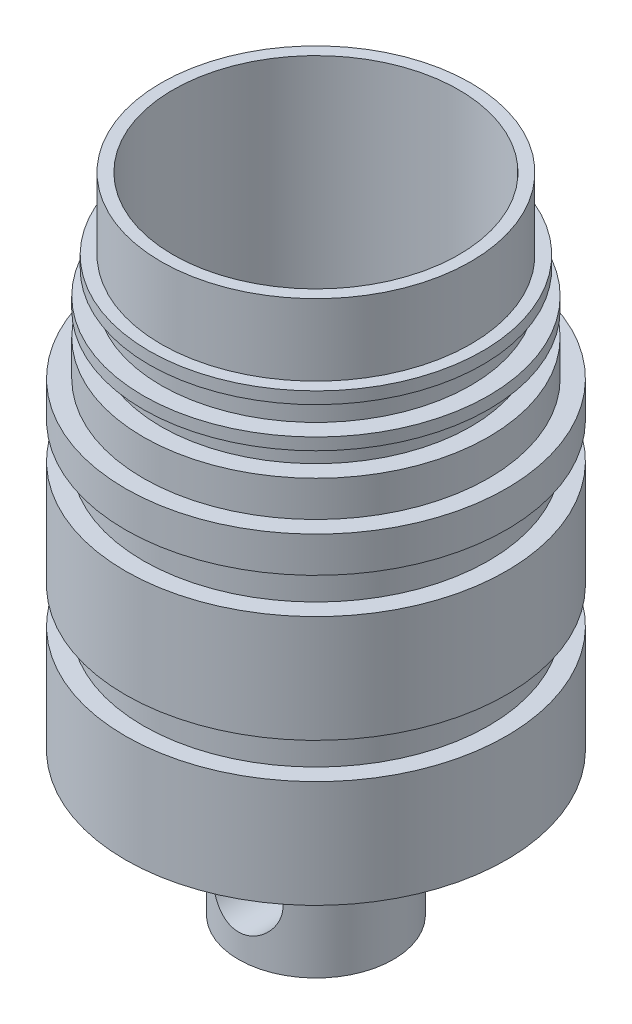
ISO-10303-21;
HEADER;
FILE_DESCRIPTION(('STEP AP214'),'2;1');
FILE_NAME('part.step','',(''),(''),'','','');
FILE_SCHEMA(('AUTOMOTIVE_DESIGN { 1 0 10303 214 1 1 1 1 }'));
ENDSEC;
DATA;
#1=APPLICATION_CONTEXT('core data for automotive mechanical design processes');
#2=APPLICATION_PROTOCOL_DEFINITION('international standard','automotive_design',2000,#1);
#3=PRODUCT_CONTEXT('',#1,'mechanical');
#4=PRODUCT('Part','Part','',(#3));
#5=PRODUCT_RELATED_PRODUCT_CATEGORY('part','',(#4));
#6=PRODUCT_DEFINITION_FORMATION('','',#4);
#7=PRODUCT_DEFINITION_CONTEXT('part definition',#1,'design');
#8=PRODUCT_DEFINITION('design','',#6,#7);
#9=PRODUCT_DEFINITION_SHAPE('','',#8);
#10=(LENGTH_UNIT() NAMED_UNIT(*) SI_UNIT(.MILLI.,.METRE.));
#11=(NAMED_UNIT(*) PLANE_ANGLE_UNIT() SI_UNIT($,.RADIAN.));
#12=(NAMED_UNIT(*) SI_UNIT($,.STERADIAN.) SOLID_ANGLE_UNIT());
#13=UNCERTAINTY_MEASURE_WITH_UNIT(LENGTH_MEASURE(1.E-05),#10,'distance_accuracy_value','');
#14=(GEOMETRIC_REPRESENTATION_CONTEXT(3) GLOBAL_UNCERTAINTY_ASSIGNED_CONTEXT((#13)) GLOBAL_UNIT_ASSIGNED_CONTEXT((#10,
#11,#12)) REPRESENTATION_CONTEXT('',''));
#15=CARTESIAN_POINT('',(0.,0.,0.));
#16=DIRECTION('',(0.,0.,1.));
#17=DIRECTION('',(1.,0.,0.));
#18=AXIS2_PLACEMENT_3D('',#15,#16,#17);
#19=CARTESIAN_POINT('',(0.,20.5,-6.5));
#20=DIRECTION('',(0.,-1.,0.));
#21=DIRECTION('',(0.,0.,-1.));
#22=AXIS2_PLACEMENT_3D('',#19,#20,#21);
#23=PLANE('',#22);
#24=CARTESIAN_POINT('',(0.,20.5,0.));
#25=DIRECTION('',(0.,1.,0.));
#26=DIRECTION('',(0.,0.,1.));
#27=AXIS2_PLACEMENT_3D('',#24,#25,#26);
#28=CIRCLE('',#27,6.);
#29=CARTESIAN_POINT('',(0.,20.5,6.));
#30=VERTEX_POINT('',#29);
#31=EDGE_CURVE('E59',#30,#30,#28,.T.);
#32=ORIENTED_EDGE('',*,*,#31,.F.);
#33=EDGE_LOOP('',(#32));
#34=FACE_BOUND('',#33,.T.);
#35=CARTESIAN_POINT('',(0.,20.5,0.));
#36=DIRECTION('',(0.,1.,0.));
#37=DIRECTION('',(0.,0.,1.));
#38=AXIS2_PLACEMENT_3D('',#35,#36,#37);
#39=CIRCLE('',#38,6.5);
#40=CARTESIAN_POINT('',(0.,20.5,6.5));
#41=VERTEX_POINT('',#40);
#42=EDGE_CURVE('E11',#41,#41,#39,.T.);
#43=ORIENTED_EDGE('',*,*,#42,.T.);
#44=EDGE_LOOP('',(#43));
#45=FACE_BOUND('',#44,.T.);
#46=ADVANCED_FACE('F33',(#34,#45),#23,.F.);
#47=CARTESIAN_POINT('',(0.,26.4066222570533,0.));
#48=DIRECTION('',(0.,1.,0.));
#49=DIRECTION('',(0.,0.,1.));
#50=AXIS2_PLACEMENT_3D('',#47,#48,#49);
#51=CYLINDRICAL_SURFACE('',#50,6.5);
#52=ORIENTED_EDGE('',*,*,#42,.F.);
#53=EDGE_LOOP('',(#52));
#54=FACE_BOUND('',#53,.T.);
#55=CARTESIAN_POINT('',(0.,17.5,0.));
#56=DIRECTION('',(0.,1.,0.));
#57=DIRECTION('',(0.,0.,1.));
#58=AXIS2_PLACEMENT_3D('',#55,#56,#57);
#59=CIRCLE('',#58,6.5);
#60=CARTESIAN_POINT('',(0.,17.5,6.5));
#61=VERTEX_POINT('',#60);
#62=EDGE_CURVE('E44',#61,#61,#59,.T.);
#63=ORIENTED_EDGE('',*,*,#62,.T.);
#64=EDGE_LOOP('',(#63));
#65=FACE_BOUND('',#64,.T.);
#66=ADVANCED_FACE('F154',(#54,#65),#51,.T.);
#67=CARTESIAN_POINT('',(0.,17.5,-7.));
#68=DIRECTION('',(0.,-1.,0.));
#69=DIRECTION('',(0.,0.,-1.));
#70=AXIS2_PLACEMENT_3D('',#67,#68,#69);
#71=PLANE('',#70);
#72=ORIENTED_EDGE('',*,*,#62,.F.);
#73=EDGE_LOOP('',(#72));
#74=FACE_BOUND('',#73,.T.);
#75=CARTESIAN_POINT('',(0.,17.5,0.));
#76=DIRECTION('',(0.,1.,0.));
#77=DIRECTION('',(0.,0.,1.));
#78=AXIS2_PLACEMENT_3D('',#75,#76,#77);
#79=CIRCLE('',#78,7.);
#80=CARTESIAN_POINT('',(0.,17.5,7.));
#81=VERTEX_POINT('',#80);
#82=EDGE_CURVE('E126',#81,#81,#79,.T.);
#83=ORIENTED_EDGE('',*,*,#82,.T.);
#84=EDGE_LOOP('',(#83));
#85=FACE_BOUND('',#84,.T.);
#86=ADVANCED_FACE('F159',(#74,#85),#71,.F.);
#87=CARTESIAN_POINT('',(0.,26.4066222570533,0.));
#88=DIRECTION('',(0.,1.,0.));
#89=DIRECTION('',(0.,0.,1.));
#90=AXIS2_PLACEMENT_3D('',#87,#88,#89);
#91=CYLINDRICAL_SURFACE('',#90,7.);
#92=ORIENTED_EDGE('',*,*,#82,.F.);
#93=EDGE_LOOP('',(#92));
#94=FACE_BOUND('',#93,.T.);
#95=CARTESIAN_POINT('',(0.,17.,0.));
#96=DIRECTION('',(0.,1.,0.));
#97=DIRECTION('',(0.,0.,1.));
#98=AXIS2_PLACEMENT_3D('',#95,#96,#97);
#99=CIRCLE('',#98,7.);
#100=CARTESIAN_POINT('',(0.,17.,7.));
#101=VERTEX_POINT('',#100);
#102=EDGE_CURVE('E123',#101,#101,#99,.T.);
#103=ORIENTED_EDGE('',*,*,#102,.T.);
#104=EDGE_LOOP('',(#103));
#105=FACE_BOUND('',#104,.T.);
#106=ADVANCED_FACE('F169',(#94,#105),#91,.T.);
#107=CARTESIAN_POINT('',(0.,17.,-6.5));
#108=DIRECTION('',(0.,1.,0.));
#109=DIRECTION('',(0.,0.,1.));
#110=AXIS2_PLACEMENT_3D('',#107,#108,#109);
#111=PLANE('',#110);
#112=ORIENTED_EDGE('',*,*,#102,.F.);
#113=EDGE_LOOP('',(#112));
#114=FACE_BOUND('',#113,.T.);
#115=CARTESIAN_POINT('',(0.,17.,0.));
#116=DIRECTION('',(0.,1.,0.));
#117=DIRECTION('',(0.,0.,1.));
#118=AXIS2_PLACEMENT_3D('',#115,#116,#117);
#119=CIRCLE('',#118,6.5);
#120=CARTESIAN_POINT('',(0.,17.,6.5));
#121=VERTEX_POINT('',#120);
#122=EDGE_CURVE('E120',#121,#121,#119,.T.);
#123=ORIENTED_EDGE('',*,*,#122,.T.);
#124=EDGE_LOOP('',(#123));
#125=FACE_BOUND('',#124,.T.);
#126=ADVANCED_FACE('F175',(#114,#125),#111,.F.);
#127=CARTESIAN_POINT('',(0.,26.4066222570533,0.));
#128=DIRECTION('',(0.,1.,0.));
#129=DIRECTION('',(0.,0.,1.));
#130=AXIS2_PLACEMENT_3D('',#127,#128,#129);
#131=CYLINDRICAL_SURFACE('',#130,6.5);
#132=ORIENTED_EDGE('',*,*,#122,.F.);
#133=EDGE_LOOP('',(#132));
#134=FACE_BOUND('',#133,.T.);
#135=CARTESIAN_POINT('',(0.,16.,0.));
#136=DIRECTION('',(0.,1.,0.));
#137=DIRECTION('',(0.,0.,1.));
#138=AXIS2_PLACEMENT_3D('',#135,#136,#137);
#139=CIRCLE('',#138,6.5);
#140=CARTESIAN_POINT('',(0.,16.,6.5));
#141=VERTEX_POINT('',#140);
#142=EDGE_CURVE('E117',#141,#141,#139,.T.);
#143=ORIENTED_EDGE('',*,*,#142,.T.);
#144=EDGE_LOOP('',(#143));
#145=FACE_BOUND('',#144,.T.);
#146=ADVANCED_FACE('F181',(#134,#145),#131,.T.);
#147=CARTESIAN_POINT('',(0.,16.,-7.25));
#148=DIRECTION('',(0.,-1.,0.));
#149=DIRECTION('',(0.,0.,-1.));
#150=AXIS2_PLACEMENT_3D('',#147,#148,#149);
#151=PLANE('',#150);
#152=ORIENTED_EDGE('',*,*,#142,.F.);
#153=EDGE_LOOP('',(#152));
#154=FACE_BOUND('',#153,.T.);
#155=CARTESIAN_POINT('',(0.,16.,0.));
#156=DIRECTION('',(0.,1.,0.));
#157=DIRECTION('',(0.,0.,1.));
#158=AXIS2_PLACEMENT_3D('',#155,#156,#157);
#159=CIRCLE('',#158,7.25);
#160=CARTESIAN_POINT('',(0.,16.,7.25));
#161=VERTEX_POINT('',#160);
#162=EDGE_CURVE('E114',#161,#161,#159,.T.);
#163=ORIENTED_EDGE('',*,*,#162,.T.);
#164=EDGE_LOOP('',(#163));
#165=FACE_BOUND('',#164,.T.);
#166=ADVANCED_FACE('F187',(#154,#165),#151,.F.);
#167=CARTESIAN_POINT('',(0.,26.4066222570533,0.));
#168=DIRECTION('',(0.,1.,0.));
#169=DIRECTION('',(0.,0.,1.));
#170=AXIS2_PLACEMENT_3D('',#167,#168,#169);
#171=CYLINDRICAL_SURFACE('',#170,7.25);
#172=ORIENTED_EDGE('',*,*,#162,.F.);
#173=EDGE_LOOP('',(#172));
#174=FACE_BOUND('',#173,.T.);
#175=CARTESIAN_POINT('',(0.,15.5,0.));
#176=DIRECTION('',(0.,1.,0.));
#177=DIRECTION('',(0.,0.,1.));
#178=AXIS2_PLACEMENT_3D('',#175,#176,#177);
#179=CIRCLE('',#178,7.25);
#180=CARTESIAN_POINT('',(0.,15.5,7.25));
#181=VERTEX_POINT('',#180);
#182=EDGE_CURVE('E111',#181,#181,#179,.T.);
#183=ORIENTED_EDGE('',*,*,#182,.T.);
#184=EDGE_LOOP('',(#183));
#185=FACE_BOUND('',#184,.T.);
#186=ADVANCED_FACE('F193',(#174,#185),#171,.T.);
#187=CARTESIAN_POINT('',(0.,15.5,-6.5));
#188=DIRECTION('',(0.,1.,0.));
#189=DIRECTION('',(0.,0.,1.));
#190=AXIS2_PLACEMENT_3D('',#187,#188,#189);
#191=PLANE('',#190);
#192=ORIENTED_EDGE('',*,*,#182,.F.);
#193=EDGE_LOOP('',(#192));
#194=FACE_BOUND('',#193,.T.);
#195=CARTESIAN_POINT('',(0.,15.5,0.));
#196=DIRECTION('',(0.,1.,0.));
#197=DIRECTION('',(0.,0.,1.));
#198=AXIS2_PLACEMENT_3D('',#195,#196,#197);
#199=CIRCLE('',#198,6.5);
#200=CARTESIAN_POINT('',(0.,15.5,6.5));
#201=VERTEX_POINT('',#200);
#202=EDGE_CURVE('E108',#201,#201,#199,.T.);
#203=ORIENTED_EDGE('',*,*,#202,.T.);
#204=EDGE_LOOP('',(#203));
#205=FACE_BOUND('',#204,.T.);
#206=ADVANCED_FACE('F199',(#194,#205),#191,.F.);
#207=CARTESIAN_POINT('',(0.,26.4066222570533,0.));
#208=DIRECTION('',(0.,1.,0.));
#209=DIRECTION('',(0.,0.,1.));
#210=AXIS2_PLACEMENT_3D('',#207,#208,#209);
#211=CYLINDRICAL_SURFACE('',#210,6.5);
#212=ORIENTED_EDGE('',*,*,#202,.F.);
#213=EDGE_LOOP('',(#212));
#214=FACE_BOUND('',#213,.T.);
#215=CARTESIAN_POINT('',(0.,14.5,0.));
#216=DIRECTION('',(0.,1.,0.));
#217=DIRECTION('',(0.,0.,1.));
#218=AXIS2_PLACEMENT_3D('',#215,#216,#217);
#219=CIRCLE('',#218,6.5);
#220=CARTESIAN_POINT('',(0.,14.5,6.5));
#221=VERTEX_POINT('',#220);
#222=EDGE_CURVE('E105',#221,#221,#219,.T.);
#223=ORIENTED_EDGE('',*,*,#222,.T.);
#224=EDGE_LOOP('',(#223));
#225=FACE_BOUND('',#224,.T.);
#226=ADVANCED_FACE('F205',(#214,#225),#211,.T.);
#227=CARTESIAN_POINT('',(0.,14.5,-7.25));
#228=DIRECTION('',(0.,-1.,0.));
#229=DIRECTION('',(0.,0.,-1.));
#230=AXIS2_PLACEMENT_3D('',#227,#228,#229);
#231=PLANE('',#230);
#232=ORIENTED_EDGE('',*,*,#222,.F.);
#233=EDGE_LOOP('',(#232));
#234=FACE_BOUND('',#233,.T.);
#235=CARTESIAN_POINT('',(0.,14.5,0.));
#236=DIRECTION('',(0.,1.,0.));
#237=DIRECTION('',(0.,0.,1.));
#238=AXIS2_PLACEMENT_3D('',#235,#236,#237);
#239=CIRCLE('',#238,7.25);
#240=CARTESIAN_POINT('',(0.,14.5,7.25));
#241=VERTEX_POINT('',#240);
#242=EDGE_CURVE('E102',#241,#241,#239,.T.);
#243=ORIENTED_EDGE('',*,*,#242,.T.);
#244=EDGE_LOOP('',(#243));
#245=FACE_BOUND('',#244,.T.);
#246=ADVANCED_FACE('F211',(#234,#245),#231,.F.);
#247=CARTESIAN_POINT('',(0.,26.4066222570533,0.));
#248=DIRECTION('',(0.,1.,0.));
#249=DIRECTION('',(0.,0.,1.));
#250=AXIS2_PLACEMENT_3D('',#247,#248,#249);
#251=CYLINDRICAL_SURFACE('',#250,7.25);
#252=ORIENTED_EDGE('',*,*,#242,.F.);
#253=EDGE_LOOP('',(#252));
#254=FACE_BOUND('',#253,.T.);
#255=CARTESIAN_POINT('',(0.,13.,0.));
#256=DIRECTION('',(0.,1.,0.));
#257=DIRECTION('',(0.,0.,1.));
#258=AXIS2_PLACEMENT_3D('',#255,#256,#257);
#259=CIRCLE('',#258,7.25);
#260=CARTESIAN_POINT('',(0.,13.,7.25));
#261=VERTEX_POINT('',#260);
#262=EDGE_CURVE('E99',#261,#261,#259,.T.);
#263=ORIENTED_EDGE('',*,*,#262,.T.);
#264=EDGE_LOOP('',(#263));
#265=FACE_BOUND('',#264,.T.);
#266=ADVANCED_FACE('F217',(#254,#265),#251,.T.);
#267=CARTESIAN_POINT('',(0.,13.,-8.));
#268=DIRECTION('',(0.,-1.,0.));
#269=DIRECTION('',(0.,0.,-1.));
#270=AXIS2_PLACEMENT_3D('',#267,#268,#269);
#271=PLANE('',#270);
#272=ORIENTED_EDGE('',*,*,#262,.F.);
#273=EDGE_LOOP('',(#272));
#274=FACE_BOUND('',#273,.T.);
#275=CARTESIAN_POINT('',(0.,13.,0.));
#276=DIRECTION('',(0.,1.,0.));
#277=DIRECTION('',(0.,0.,1.));
#278=AXIS2_PLACEMENT_3D('',#275,#276,#277);
#279=CIRCLE('',#278,8.);
#280=CARTESIAN_POINT('',(0.,13.,8.));
#281=VERTEX_POINT('',#280);
#282=EDGE_CURVE('E96',#281,#281,#279,.T.);
#283=ORIENTED_EDGE('',*,*,#282,.T.);
#284=EDGE_LOOP('',(#283));
#285=FACE_BOUND('',#284,.T.);
#286=ADVANCED_FACE('F223',(#274,#285),#271,.F.);
#287=CARTESIAN_POINT('',(0.,26.4066222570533,0.));
#288=DIRECTION('',(0.,1.,0.));
#289=DIRECTION('',(0.,0.,1.));
#290=AXIS2_PLACEMENT_3D('',#287,#288,#289);
#291=CYLINDRICAL_SURFACE('',#290,8.);
#292=ORIENTED_EDGE('',*,*,#282,.F.);
#293=EDGE_LOOP('',(#292));
#294=FACE_BOUND('',#293,.T.);
#295=CARTESIAN_POINT('',(0.,11.5,0.));
#296=DIRECTION('',(0.,1.,0.));
#297=DIRECTION('',(0.,0.,1.));
#298=AXIS2_PLACEMENT_3D('',#295,#296,#297);
#299=CIRCLE('',#298,8.);
#300=CARTESIAN_POINT('',(0.,11.5,8.));
#301=VERTEX_POINT('',#300);
#302=EDGE_CURVE('E93',#301,#301,#299,.T.);
#303=ORIENTED_EDGE('',*,*,#302,.T.);
#304=EDGE_LOOP('',(#303));
#305=FACE_BOUND('',#304,.T.);
#306=ADVANCED_FACE('F229',(#294,#305),#291,.T.);
#307=CARTESIAN_POINT('',(0.,11.5,-7.25));
#308=DIRECTION('',(0.,1.,0.));
#309=DIRECTION('',(0.,0.,1.));
#310=AXIS2_PLACEMENT_3D('',#307,#308,#309);
#311=PLANE('',#310);
#312=ORIENTED_EDGE('',*,*,#302,.F.);
#313=EDGE_LOOP('',(#312));
#314=FACE_BOUND('',#313,.T.);
#315=CARTESIAN_POINT('',(0.,11.5,0.));
#316=DIRECTION('',(0.,1.,0.));
#317=DIRECTION('',(0.,0.,1.));
#318=AXIS2_PLACEMENT_3D('',#315,#316,#317);
#319=CIRCLE('',#318,7.25);
#320=CARTESIAN_POINT('',(0.,11.5,7.25));
#321=VERTEX_POINT('',#320);
#322=EDGE_CURVE('E90',#321,#321,#319,.T.);
#323=ORIENTED_EDGE('',*,*,#322,.T.);
#324=EDGE_LOOP('',(#323));
#325=FACE_BOUND('',#324,.T.);
#326=ADVANCED_FACE('F235',(#314,#325),#311,.F.);
#327=CARTESIAN_POINT('',(0.,26.4066222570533,0.));
#328=DIRECTION('',(0.,1.,0.));
#329=DIRECTION('',(0.,0.,1.));
#330=AXIS2_PLACEMENT_3D('',#327,#328,#329);
#331=CYLINDRICAL_SURFACE('',#330,7.25);
#332=ORIENTED_EDGE('',*,*,#322,.F.);
#333=EDGE_LOOP('',(#332));
#334=FACE_BOUND('',#333,.T.);
#335=CARTESIAN_POINT('',(0.,10.,0.));
#336=DIRECTION('',(0.,1.,0.));
#337=DIRECTION('',(0.,0.,1.));
#338=AXIS2_PLACEMENT_3D('',#335,#336,#337);
#339=CIRCLE('',#338,7.25);
#340=CARTESIAN_POINT('',(0.,10.,7.25));
#341=VERTEX_POINT('',#340);
#342=EDGE_CURVE('E87',#341,#341,#339,.T.);
#343=ORIENTED_EDGE('',*,*,#342,.T.);
#344=EDGE_LOOP('',(#343));
#345=FACE_BOUND('',#344,.T.);
#346=ADVANCED_FACE('F241',(#334,#345),#331,.T.);
#347=CARTESIAN_POINT('',(0.,10.,-8.));
#348=DIRECTION('',(0.,-1.,0.));
#349=DIRECTION('',(0.,0.,-1.));
#350=AXIS2_PLACEMENT_3D('',#347,#348,#349);
#351=PLANE('',#350);
#352=ORIENTED_EDGE('',*,*,#342,.F.);
#353=EDGE_LOOP('',(#352));
#354=FACE_BOUND('',#353,.T.);
#355=CARTESIAN_POINT('',(0.,10.,0.));
#356=DIRECTION('',(0.,1.,0.));
#357=DIRECTION('',(0.,0.,1.));
#358=AXIS2_PLACEMENT_3D('',#355,#356,#357);
#359=CIRCLE('',#358,8.);
#360=CARTESIAN_POINT('',(0.,10.,8.));
#361=VERTEX_POINT('',#360);
#362=EDGE_CURVE('E84',#361,#361,#359,.T.);
#363=ORIENTED_EDGE('',*,*,#362,.T.);
#364=EDGE_LOOP('',(#363));
#365=FACE_BOUND('',#364,.T.);
#366=ADVANCED_FACE('F247',(#354,#365),#351,.F.);
#367=CARTESIAN_POINT('',(0.,26.4066222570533,0.));
#368=DIRECTION('',(0.,1.,0.));
#369=DIRECTION('',(0.,0.,1.));
#370=AXIS2_PLACEMENT_3D('',#367,#368,#369);
#371=CYLINDRICAL_SURFACE('',#370,8.);
#372=ORIENTED_EDGE('',*,*,#362,.F.);
#373=EDGE_LOOP('',(#372));
#374=FACE_BOUND('',#373,.T.);
#375=CARTESIAN_POINT('',(0.,5.50000000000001,0.));
#376=DIRECTION('',(0.,1.,0.));
#377=DIRECTION('',(0.,0.,1.));
#378=AXIS2_PLACEMENT_3D('',#375,#376,#377);
#379=CIRCLE('',#378,8.);
#380=CARTESIAN_POINT('',(0.,5.50000000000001,8.));
#381=VERTEX_POINT('',#380);
#382=EDGE_CURVE('E81',#381,#381,#379,.T.);
#383=ORIENTED_EDGE('',*,*,#382,.T.);
#384=EDGE_LOOP('',(#383));
#385=FACE_BOUND('',#384,.T.);
#386=ADVANCED_FACE('F253',(#374,#385),#371,.T.);
#387=CARTESIAN_POINT('',(0.,5.5,-7.25));
#388=DIRECTION('',(0.,1.,0.));
#389=DIRECTION('',(0.,0.,1.));
#390=AXIS2_PLACEMENT_3D('',#387,#388,#389);
#391=PLANE('',#390);
#392=ORIENTED_EDGE('',*,*,#382,.F.);
#393=EDGE_LOOP('',(#392));
#394=FACE_BOUND('',#393,.T.);
#395=CARTESIAN_POINT('',(0.,5.50000000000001,0.));
#396=DIRECTION('',(0.,1.,0.));
#397=DIRECTION('',(0.,0.,1.));
#398=AXIS2_PLACEMENT_3D('',#395,#396,#397);
#399=CIRCLE('',#398,7.25);
#400=CARTESIAN_POINT('',(0.,5.50000000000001,7.25));
#401=VERTEX_POINT('',#400);
#402=EDGE_CURVE('E78',#401,#401,#399,.T.);
#403=ORIENTED_EDGE('',*,*,#402,.T.);
#404=EDGE_LOOP('',(#403));
#405=FACE_BOUND('',#404,.T.);
#406=ADVANCED_FACE('F259',(#394,#405),#391,.F.);
#407=CARTESIAN_POINT('',(0.,26.4066222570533,0.));
#408=DIRECTION('',(0.,1.,0.));
#409=DIRECTION('',(0.,0.,1.));
#410=AXIS2_PLACEMENT_3D('',#407,#408,#409);
#411=CYLINDRICAL_SURFACE('',#410,7.25);
#412=ORIENTED_EDGE('',*,*,#402,.F.);
#413=EDGE_LOOP('',(#412));
#414=FACE_BOUND('',#413,.T.);
#415=CARTESIAN_POINT('',(0.,4.,0.));
#416=DIRECTION('',(0.,1.,0.));
#417=DIRECTION('',(0.,0.,1.));
#418=AXIS2_PLACEMENT_3D('',#415,#416,#417);
#419=CIRCLE('',#418,7.25);
#420=CARTESIAN_POINT('',(0.,4.,7.25));
#421=VERTEX_POINT('',#420);
#422=EDGE_CURVE('E75',#421,#421,#419,.T.);
#423=ORIENTED_EDGE('',*,*,#422,.T.);
#424=EDGE_LOOP('',(#423));
#425=FACE_BOUND('',#424,.T.);
#426=ADVANCED_FACE('F265',(#414,#425),#411,.T.);
#427=CARTESIAN_POINT('',(0.,4.,-8.));
#428=DIRECTION('',(0.,-1.,0.));
#429=DIRECTION('',(0.,0.,-1.));
#430=AXIS2_PLACEMENT_3D('',#427,#428,#429);
#431=PLANE('',#430);
#432=ORIENTED_EDGE('',*,*,#422,.F.);
#433=EDGE_LOOP('',(#432));
#434=FACE_BOUND('',#433,.T.);
#435=CARTESIAN_POINT('',(0.,4.,0.));
#436=DIRECTION('',(0.,1.,0.));
#437=DIRECTION('',(0.,0.,1.));
#438=AXIS2_PLACEMENT_3D('',#435,#436,#437);
#439=CIRCLE('',#438,8.);
#440=CARTESIAN_POINT('',(0.,4.,8.));
#441=VERTEX_POINT('',#440);
#442=EDGE_CURVE('E72',#441,#441,#439,.T.);
#443=ORIENTED_EDGE('',*,*,#442,.T.);
#444=EDGE_LOOP('',(#443));
#445=FACE_BOUND('',#444,.T.);
#446=ADVANCED_FACE('F271',(#434,#445),#431,.F.);
#447=CARTESIAN_POINT('',(0.,26.4066222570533,0.));
#448=DIRECTION('',(0.,1.,0.));
#449=DIRECTION('',(0.,0.,1.));
#450=AXIS2_PLACEMENT_3D('',#447,#448,#449);
#451=CYLINDRICAL_SURFACE('',#450,8.);
#452=ORIENTED_EDGE('',*,*,#442,.F.);
#453=EDGE_LOOP('',(#452));
#454=FACE_BOUND('',#453,.T.);
#455=CARTESIAN_POINT('',(0.,-0.499999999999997,0.));
#456=DIRECTION('',(0.,1.,0.));
#457=DIRECTION('',(0.,0.,1.));
#458=AXIS2_PLACEMENT_3D('',#455,#456,#457);
#459=CIRCLE('',#458,8.);
#460=CARTESIAN_POINT('',(0.,-0.499999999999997,8.));
#461=VERTEX_POINT('',#460);
#462=EDGE_CURVE('E69',#461,#461,#459,.T.);
#463=ORIENTED_EDGE('',*,*,#462,.T.);
#464=EDGE_LOOP('',(#463));
#465=FACE_BOUND('',#464,.T.);
#466=ADVANCED_FACE('F277',(#454,#465),#451,.T.);
#467=CARTESIAN_POINT('',(0.,-2.08333333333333,0.));
#468=DIRECTION('',(0.,1.,0.));
#469=DIRECTION('',(0.,0.,1.));
#470=AXIS2_PLACEMENT_3D('',#467,#468,#469);
#471=CONICAL_SURFACE('',#470,3.25,1.24904577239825);
#472=ORIENTED_EDGE('',*,*,#462,.F.);
#473=EDGE_LOOP('',(#472));
#474=FACE_BOUND('',#473,.T.);
#475=CARTESIAN_POINT('',(0.,-2.08333333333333,0.));
#476=DIRECTION('',(0.,1.,0.));
#477=DIRECTION('',(0.,0.,1.));
#478=AXIS2_PLACEMENT_3D('',#475,#476,#477);
#479=CIRCLE('',#478,3.25);
#480=CARTESIAN_POINT('',(0.,-2.08333333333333,3.25));
#481=VERTEX_POINT('',#480);
#482=EDGE_CURVE('E62',#481,#481,#479,.T.);
#483=ORIENTED_EDGE('',*,*,#482,.T.);
#484=EDGE_LOOP('',(#483));
#485=FACE_BOUND('',#484,.T.);
#486=ADVANCED_FACE('F150',(#474,#485),#471,.T.);
#487=CARTESIAN_POINT('',(0.,26.4066222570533,0.));
#488=DIRECTION('',(0.,1.,0.));
#489=DIRECTION('',(0.,0.,1.));
#490=AXIS2_PLACEMENT_3D('',#487,#488,#489);
#491=CYLINDRICAL_SURFACE('',#490,3.25);
#492=CARTESIAN_POINT('',(0.,-5.5,3.25));
#493=CARTESIAN_POINT('',(-0.0795665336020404,-5.49999578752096,3.24999648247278));
#494=CARTESIAN_POINT('',(-0.159248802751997,-5.49363186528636,3.24704578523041));
#495=CARTESIAN_POINT('',(-0.316302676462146,-5.46843681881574,3.23553478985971));
#496=CARTESIAN_POINT('',(-0.393668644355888,-5.44957751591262,3.22696181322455));
#497=CARTESIAN_POINT('',(-0.543571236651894,-5.40026133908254,3.20511261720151));
#498=CARTESIAN_POINT('',(-0.616124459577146,-5.36984705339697,3.19185368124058));
#499=CARTESIAN_POINT('',(-0.755011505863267,-5.29848316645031,3.16188428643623));
#500=CARTESIAN_POINT('',(-0.821346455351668,-5.2575354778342,3.14517445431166));
#501=CARTESIAN_POINT('',(-0.949934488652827,-5.16374129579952,3.10883035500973));
#502=CARTESIAN_POINT('',(-1.01177584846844,-5.11037308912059,3.08908710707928));
#503=CARTESIAN_POINT('',(-1.12599874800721,-4.99436437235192,3.04931006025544));
#504=CARTESIAN_POINT('',(-1.17837420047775,-4.93171794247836,3.02927608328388));
#505=CARTESIAN_POINT('',(-1.27548887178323,-4.79413905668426,2.98974101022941));
#506=CARTESIAN_POINT('',(-1.31953284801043,-4.71867930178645,2.97035435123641));
#507=CARTESIAN_POINT('',(-1.39412192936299,-4.56041325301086,2.93608939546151));
#508=CARTESIAN_POINT('',(-1.42467548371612,-4.4776115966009,2.92120827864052));
#509=CARTESIAN_POINT('',(-1.46962454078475,-4.31172452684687,2.89884571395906));
#510=CARTESIAN_POINT('',(-1.4848179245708,-4.22890638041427,2.8910015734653));
#511=CARTESIAN_POINT('',(-1.50108773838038,-4.06155427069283,2.88259066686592));
#512=CARTESIAN_POINT('',(-1.50217478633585,-3.97702164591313,2.88201842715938));
#513=CARTESIAN_POINT('',(-1.49079280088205,-3.81752568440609,2.88791642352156));
#514=CARTESIAN_POINT('',(-1.47964335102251,-3.74243721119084,2.89370119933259));
#515=CARTESIAN_POINT('',(-1.44635609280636,-3.59534888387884,2.91048067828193));
#516=CARTESIAN_POINT('',(-1.42421554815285,-3.52334980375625,2.92147667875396));
#517=CARTESIAN_POINT('',(-1.36913890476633,-3.38249571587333,2.94769456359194));
#518=CARTESIAN_POINT('',(-1.33596673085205,-3.31375077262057,2.96300763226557));
#519=CARTESIAN_POINT('',(-1.2599408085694,-3.18249923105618,2.99612519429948));
#520=CARTESIAN_POINT('',(-1.21708286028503,-3.11999535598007,3.01393076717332));
#521=CARTESIAN_POINT('',(-1.11759089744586,-2.99602959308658,3.0523140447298));
#522=CARTESIAN_POINT('',(-1.05997849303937,-2.93537947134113,3.07298560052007));
#523=CARTESIAN_POINT('',(-0.935250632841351,-2.82429449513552,3.1132136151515));
#524=CARTESIAN_POINT('',(-0.868131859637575,-2.77386322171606,3.13276968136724));
#525=CARTESIAN_POINT('',(-0.723348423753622,-2.68306809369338,3.16938837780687));
#526=CARTESIAN_POINT('',(-0.645401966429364,-2.64310669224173,3.18634309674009));
#527=CARTESIAN_POINT('',(-0.482909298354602,-2.57716063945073,3.21497815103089));
#528=CARTESIAN_POINT('',(-0.398367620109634,-2.55116648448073,3.22666207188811));
#529=CARTESIAN_POINT('',(-0.231801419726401,-2.5157584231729,3.2427218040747));
#530=CARTESIAN_POINT('',(-0.150053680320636,-2.50525979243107,3.24757449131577));
#531=CARTESIAN_POINT('',(0.0141754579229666,-2.49781893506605,3.25100513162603));
#532=CARTESIAN_POINT('',(0.0966565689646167,-2.50087160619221,3.2495854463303));
#533=CARTESIAN_POINT('',(0.2544477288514,-2.51974050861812,3.2409269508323));
#534=CARTESIAN_POINT('',(0.329879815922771,-2.53473101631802,3.2340647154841));
#535=CARTESIAN_POINT('',(0.477039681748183,-2.57582597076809,3.21565473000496));
#536=CARTESIAN_POINT('',(0.548767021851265,-2.60193173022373,3.20410642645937));
#537=CARTESIAN_POINT('',(0.689005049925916,-2.66531765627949,3.17695345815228));
#538=CARTESIAN_POINT('',(0.757348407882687,-2.70291749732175,3.16123471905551));
#539=CARTESIAN_POINT('',(0.886999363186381,-2.78787537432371,3.12733589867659));
#540=CARTESIAN_POINT('',(0.948303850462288,-2.83523769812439,3.10915473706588));
#541=CARTESIAN_POINT('',(1.0677160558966,-2.94311701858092,3.07030240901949));
#542=CARTESIAN_POINT('',(1.12509321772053,-3.00441583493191,3.04955167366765));
#543=CARTESIAN_POINT('',(1.22901796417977,-3.13597115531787,3.00917431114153));
#544=CARTESIAN_POINT('',(1.27556070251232,-3.20623164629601,2.98954818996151));
#545=CARTESIAN_POINT('',(1.35774539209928,-3.35651222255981,2.95315331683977));
#546=CARTESIAN_POINT('',(1.39301513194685,-3.43676319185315,2.93648892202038));
#547=CARTESIAN_POINT('',(1.44918714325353,-3.6030877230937,2.90918351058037));
#548=CARTESIAN_POINT('',(1.47010488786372,-3.68915490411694,2.89853600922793));
#549=CARTESIAN_POINT('',(1.49529060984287,-3.85643216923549,2.88561745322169));
#550=CARTESIAN_POINT('',(1.5008745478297,-3.93739294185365,2.8826853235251));
#551=CARTESIAN_POINT('',(1.49890349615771,-4.09909937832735,2.88371144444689));
#552=CARTESIAN_POINT('',(1.49135196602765,-4.17984509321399,2.88766788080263));
#553=CARTESIAN_POINT('',(1.4645026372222,-4.33294509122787,2.90136714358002));
#554=CARTESIAN_POINT('',(1.44606164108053,-4.40549167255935,2.91068674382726));
#555=CARTESIAN_POINT('',(1.39890570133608,-4.54643312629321,2.93364049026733));
#556=CARTESIAN_POINT('',(1.37018772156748,-4.61482676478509,2.94727591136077));
#557=CARTESIAN_POINT('',(1.30114142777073,-4.75046600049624,2.97843128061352));
#558=CARTESIAN_POINT('',(1.26017322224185,-4.81733958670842,2.99614786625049));
#559=CARTESIAN_POINT('',(1.16858143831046,-4.94366887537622,3.03304368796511));
#560=CARTESIAN_POINT('',(1.11795345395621,-5.00312117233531,3.05222358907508));
#561=CARTESIAN_POINT('',(1.00267081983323,-5.11890842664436,3.09212207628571));
#562=CARTESIAN_POINT('',(0.937130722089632,-5.17437734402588,3.1128088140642));
#563=CARTESIAN_POINT('',(0.796983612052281,-5.27365195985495,3.15160236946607));
#564=CARTESIAN_POINT('',(0.722372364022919,-5.3174521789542,3.16970797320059));
#565=CARTESIAN_POINT('',(0.566452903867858,-5.39159373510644,3.20123620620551));
#566=CARTESIAN_POINT('',(0.485194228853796,-5.42202548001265,3.21469015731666));
#567=CARTESIAN_POINT('',(0.318047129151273,-5.46844222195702,3.23548841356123));
#568=CARTESIAN_POINT('',(0.232173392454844,-5.48447047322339,3.24285100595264));
#569=CARTESIAN_POINT('',(0.121381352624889,-5.49527966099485,3.24782399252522));
#570=CARTESIAN_POINT('',(0.0971493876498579,-5.49704793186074,3.24863841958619));
#571=CARTESIAN_POINT('',(0.048615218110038,-5.49940875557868,3.24972696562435));
#572=CARTESIAN_POINT('',(0.0243130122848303,-5.50000128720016,3.2500010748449));
#573=CARTESIAN_POINT('',(0.,-5.5,3.25));
#574=B_SPLINE_CURVE_WITH_KNOTS('',3,(#492,#493,#494,#495,#496,#497,#498,#499,#500,#501,#502,
#503,#504,#505,#506,#507,#508,#509,#510,#511,#512,#513,#514,#515,#516,#517,#518,#519,#520,#521,
#522,#523,#524,#525,#526,#527,#528,#529,#530,#531,#532,#533,#534,#535,#536,#537,#538,#539,#540,
#541,#542,#543,#544,#545,#546,#547,#548,#549,#550,#551,#552,#553,#554,#555,#556,#557,#558,#559,
#560,#561,#562,#563,#564,#565,#566,#567,#568,#569,#570,#571,#572,#573),.UNSPECIFIED.,.T.,.F.,(4,
2,2,2,2,2,2,2,2,2,2,2,2,2,2,2,2,2,2,2,2,2,2,2,2,2,2,2,2,2,2,2,2,2,2,2,2,2,2,2,4),(0.,
0.238600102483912,0.477740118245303,0.716007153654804,0.954230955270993,1.20527368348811,
1.45647728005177,1.72361737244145,1.99058991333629,2.24284530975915,2.49491082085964,
2.72224505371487,2.94963591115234,3.1822448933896,3.41495493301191,3.67231630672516,
3.92976771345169,4.19600797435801,4.46206684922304,4.70843465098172,4.95470969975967,
5.18529144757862,5.41590043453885,5.65361863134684,5.8914414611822,6.14975555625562,
6.4081849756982,6.67442949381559,6.94038651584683,7.18267705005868,7.42490378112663,
7.65022078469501,7.87560440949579,8.11582604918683,8.3561575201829,8.61987112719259,
8.88370835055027,9.14573275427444,9.40696763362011,9.47987495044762,9.5527835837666),.UNSPECIFIED.);
#575=CARTESIAN_POINT('',(0.,-5.5,3.25));
#576=VERTEX_POINT('',#575);
#577=EDGE_CURVE('E36',#576,#576,#574,.T.);
#578=ORIENTED_EDGE('',*,*,#577,.T.);
#579=EDGE_LOOP('',(#578));
#580=FACE_BOUND('',#579,.T.);
#581=CARTESIAN_POINT('',(1.5,-4.,-2.8831406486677));
#582=CARTESIAN_POINT('',(1.49999556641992,-3.9209439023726,-2.88314571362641));
#583=CARTESIAN_POINT('',(1.49370969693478,-3.84176788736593,-2.88644015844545));
#584=CARTESIAN_POINT('',(1.46885414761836,-3.68577514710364,-2.89916399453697));
#585=CARTESIAN_POINT('',(1.45025485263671,-3.60896457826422,-2.90860817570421));
#586=CARTESIAN_POINT('',(1.40169687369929,-3.4602446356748,-2.9323139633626));
#587=CARTESIAN_POINT('',(1.37179167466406,-3.38831403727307,-2.94655285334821));
#588=CARTESIAN_POINT('',(1.30163233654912,-3.25050851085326,-2.9782090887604));
#589=CARTESIAN_POINT('',(1.26137903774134,-3.1846330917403,-2.99562617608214));
#590=CARTESIAN_POINT('',(1.16836618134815,-3.05571731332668,-3.03316714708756));
#591=CARTESIAN_POINT('',(1.11493024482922,-2.99319501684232,-3.0533950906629));
#592=CARTESIAN_POINT('',(0.998482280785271,-2.87760619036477,-3.09343234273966));
#593=CARTESIAN_POINT('',(0.935466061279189,-2.82454382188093,-3.11324146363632));
#594=CARTESIAN_POINT('',(0.797372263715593,-2.72651935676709,-3.15152392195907));
#595=CARTESIAN_POINT('',(0.721820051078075,-2.68216843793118,-3.16986256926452));
#596=CARTESIAN_POINT('',(0.563324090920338,-2.60703748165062,-3.20182516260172));
#597=CARTESIAN_POINT('',(0.480384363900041,-2.57625011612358,-3.21545165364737));
#598=CARTESIAN_POINT('',(0.314933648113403,-2.53108683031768,-3.23571086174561));
#599=CARTESIAN_POINT('',(0.232716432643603,-2.51580978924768,-3.24272563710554));
#600=CARTESIAN_POINT('',(0.0666076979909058,-2.49916004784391,-3.25037878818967));
#601=CARTESIAN_POINT('',(-0.017282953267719,-2.49778031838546,-3.25102038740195));
#602=CARTESIAN_POINT('',(-0.177691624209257,-2.50855598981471,-3.2460575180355));
#603=CARTESIAN_POINT('',(-0.254293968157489,-2.5197124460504,-3.24091400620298));
#604=CARTESIAN_POINT('',(-0.404395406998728,-2.55349266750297,-3.22562512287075));
#605=CARTESIAN_POINT('',(-0.477894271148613,-2.57611728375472,-3.21547938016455));
#606=CARTESIAN_POINT('',(-0.621056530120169,-2.63241203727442,-3.19094774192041));
#607=CARTESIAN_POINT('',(-0.690645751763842,-2.66624294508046,-3.17650045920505));
#608=CARTESIAN_POINT('',(-0.823340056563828,-2.74380590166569,-3.14472149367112));
#609=CARTESIAN_POINT('',(-0.886442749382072,-2.78754158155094,-3.12738875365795));
#610=CARTESIAN_POINT('',(-1.00998865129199,-2.8878963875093,-3.08981116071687));
#611=CARTESIAN_POINT('',(-1.0697689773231,-2.94528670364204,-3.06944399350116));
#612=CARTESIAN_POINT('',(-1.17918246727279,-3.06921149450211,-3.02909824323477));
#613=CARTESIAN_POINT('',(-1.22880979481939,-3.13575119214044,-3.00911988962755));
#614=CARTESIAN_POINT('',(-1.31879065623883,-3.28003062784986,-2.97082472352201));
#615=CARTESIAN_POINT('',(-1.35858783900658,-3.35815358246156,-2.95263289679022));
#616=CARTESIAN_POINT('',(-1.42418098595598,-3.52104416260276,-2.92156472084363));
#617=CARTESIAN_POINT('',(-1.44998952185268,-3.6058057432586,-2.90868360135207));
#618=CARTESIAN_POINT('',(-1.48498298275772,-3.77292184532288,-2.89096621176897));
#619=CARTESIAN_POINT('',(-1.49525517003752,-3.85499156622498,-2.8856059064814));
#620=CARTESIAN_POINT('',(-1.50213248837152,-4.01983961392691,-2.88203375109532));
#621=CARTESIAN_POINT('',(-1.49874447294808,-4.10261756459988,-2.88381831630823));
#622=CARTESIAN_POINT('',(-1.47939407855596,-4.25896131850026,-2.89378448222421));
#623=CARTESIAN_POINT('',(-1.46454174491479,-4.33270576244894,-2.90140090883));
#624=CARTESIAN_POINT('',(-1.42424595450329,-4.47655663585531,-2.9213910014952));
#625=CARTESIAN_POINT('',(-1.39879960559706,-4.54666206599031,-2.93376596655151));
#626=CARTESIAN_POINT('',(-1.33677544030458,-4.68485768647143,-2.96255754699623));
#627=CARTESIAN_POINT('',(-1.29974156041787,-4.75270888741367,-2.9791331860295));
#628=CARTESIAN_POINT('',(-1.21601516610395,-4.88160078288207,-3.01427720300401));
#629=CARTESIAN_POINT('',(-1.16931792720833,-4.94263812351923,-3.03284655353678));
#630=CARTESIAN_POINT('',(-1.06189125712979,-5.06279661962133,-3.07221170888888));
#631=CARTESIAN_POINT('',(-1.00020754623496,-5.12105828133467,-3.09303821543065));
#632=CARTESIAN_POINT('',(-0.86752220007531,-5.22661835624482,-3.13284209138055));
#633=CARTESIAN_POINT('',(-0.79651877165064,-5.27391465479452,-3.15181910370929));
#634=CARTESIAN_POINT('',(-0.645779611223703,-5.35663214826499,-3.1861439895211));
#635=CARTESIAN_POINT('',(-0.565941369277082,-5.39188908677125,-3.20144088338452));
#636=CARTESIAN_POINT('',(-0.400564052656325,-5.44815797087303,-3.22630112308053));
#637=CARTESIAN_POINT('',(-0.315029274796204,-5.469180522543,-3.23586873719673));
#638=CARTESIAN_POINT('',(-0.148274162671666,-5.49483726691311,-3.24760255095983));
#639=CARTESIAN_POINT('',(-0.0672765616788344,-5.50067578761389,-3.25031216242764));
#640=CARTESIAN_POINT('',(0.0945622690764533,-5.49920012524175,-3.24963056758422));
#641=CARTESIAN_POINT('',(0.175403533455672,-5.49188929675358,-3.24624091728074));
#642=CARTESIAN_POINT('',(0.330377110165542,-5.46517036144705,-3.2340523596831));
#643=CARTESIAN_POINT('',(0.404642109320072,-5.44639136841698,-3.22553506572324));
#644=CARTESIAN_POINT('',(0.548892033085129,-5.3980369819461,-3.20414398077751));
#645=CARTESIAN_POINT('',(0.618876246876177,-5.36845980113,-3.19126946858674));
#646=CARTESIAN_POINT('',(0.756120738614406,-5.297885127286,-3.16163485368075));
#647=CARTESIAN_POINT('',(0.823111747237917,-5.2564288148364,-3.14472447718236));
#648=CARTESIAN_POINT('',(0.949480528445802,-5.16388451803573,-3.10890779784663));
#649=CARTESIAN_POINT('',(1.00885489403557,-5.11279224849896,-3.09000060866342));
#650=CARTESIAN_POINT('',(1.12361573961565,-4.99732938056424,-3.05024317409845));
#651=CARTESIAN_POINT('',(1.17822919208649,-4.93219761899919,-3.02936483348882));
#652=CARTESIAN_POINT('',(1.27595496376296,-4.79319512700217,-2.98952045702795));
#653=CARTESIAN_POINT('',(1.31905938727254,-4.71931844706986,-2.9705557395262));
#654=CARTESIAN_POINT('',(1.39277649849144,-4.56362622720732,-2.9367233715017));
#655=CARTESIAN_POINT('',(1.42324593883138,-4.48173200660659,-2.92190329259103));
#656=CARTESIAN_POINT('',(1.4695281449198,-4.31316319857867,-2.89890919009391));
#657=CARTESIAN_POINT('',(1.48539011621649,-4.22650570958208,-2.8907128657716));
#658=CARTESIAN_POINT('',(1.49569022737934,-4.11599142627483,-2.88537886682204));
#659=CARTESIAN_POINT('',(1.49730457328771,-4.09283400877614,-2.88454161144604));
#660=CARTESIAN_POINT('',(1.49946013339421,-4.04645451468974,-2.88342174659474));
#661=CARTESIAN_POINT('',(1.50000130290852,-4.02323243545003,-2.88313916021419));
#662=CARTESIAN_POINT('',(1.5,-4.,-2.8831406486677));
#663=B_SPLINE_CURVE_WITH_KNOTS('',3,(#581,#582,#583,#584,#585,#586,#587,#588,#589,#590,#591,
#592,#593,#594,#595,#596,#597,#598,#599,#600,#601,#602,#603,#604,#605,#606,#607,#608,#609,#610,
#611,#612,#613,#614,#615,#616,#617,#618,#619,#620,#621,#622,#623,#624,#625,#626,#627,#628,#629,
#630,#631,#632,#633,#634,#635,#636,#637,#638,#639,#640,#641,#642,#643,#644,#645,#646,#647,#648,
#649,#650,#651,#652,#653,#654,#655,#656,#657,#658,#659,#660,#661,#662),.UNSPECIFIED.,.T.,.F.,(4,
2,2,2,2,2,2,2,2,2,2,2,2,2,2,2,2,2,2,2,2,2,2,2,2,2,2,2,2,2,2,2,2,2,2,2,2,2,2,2,4),(0.,
0.237070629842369,0.474713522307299,0.711245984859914,0.947759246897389,1.20076595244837,
1.45388368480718,1.72101627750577,1.98800436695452,2.23839767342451,2.48866432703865,
2.72031924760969,2.95199136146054,3.18714254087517,3.42238006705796,3.67727504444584,
3.93231613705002,4.19954224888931,4.46652780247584,4.71378889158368,4.96092594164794,
5.1867417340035,5.41261921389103,5.64883211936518,5.88516078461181,6.14606812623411,
6.40702574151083,6.67141336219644,6.93560376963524,7.1780930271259,7.42052043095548,
7.65071362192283,7.88094493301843,8.12166304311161,8.36248845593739,8.62387073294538,
8.88543187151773,9.14988229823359,9.41343862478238,9.48310433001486,9.5527729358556),.UNSPECIFIED.);
#664=CARTESIAN_POINT('',(1.5,-4.,-2.8831406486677));
#665=VERTEX_POINT('',#664);
#666=EDGE_CURVE('E130',#665,#665,#663,.T.);
#667=ORIENTED_EDGE('',*,*,#666,.T.);
#668=EDGE_LOOP('',(#667));
#669=FACE_BOUND('',#668,.T.);
#670=ORIENTED_EDGE('',*,*,#482,.F.);
#671=EDGE_LOOP('',(#670));
#672=FACE_BOUND('',#671,.T.);
#673=CARTESIAN_POINT('',(0.,-6.5,0.));
#674=DIRECTION('',(0.,1.,0.));
#675=DIRECTION('',(0.,0.,1.));
#676=AXIS2_PLACEMENT_3D('',#673,#674,#675);
#677=CIRCLE('',#676,3.25);
#678=CARTESIAN_POINT('',(0.,-6.5,3.25));
#679=VERTEX_POINT('',#678);
#680=EDGE_CURVE('E58',#679,#679,#677,.T.);
#681=ORIENTED_EDGE('',*,*,#680,.T.);
#682=EDGE_LOOP('',(#681));
#683=FACE_BOUND('',#682,.T.);
#684=ADVANCED_FACE('F134',(#580,#669,#672,#683),#491,.T.);
#685=CARTESIAN_POINT('',(0.,-6.5,0.));
#686=DIRECTION('',(0.,1.,0.));
#687=DIRECTION('',(0.,0.,1.));
#688=AXIS2_PLACEMENT_3D('',#685,#686,#687);
#689=PLANE('',#688);
#690=ORIENTED_EDGE('',*,*,#680,.F.);
#691=EDGE_LOOP('',(#690));
#692=FACE_BOUND('',#691,.T.);
#693=ADVANCED_FACE('F52',(#692),#689,.F.);
#694=CARTESIAN_POINT('',(0.,0.,0.));
#695=DIRECTION('',(0.,1.,0.));
#696=DIRECTION('',(0.,0.,1.));
#697=AXIS2_PLACEMENT_3D('',#694,#695,#696);
#698=CONICAL_SURFACE('',#697,6.,1.24904577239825);
#699=CARTESIAN_POINT('',(0.,-2.,0.));
#700=VERTEX_POINT('',#699);
#701=VERTEX_LOOP('',#700);
#702=FACE_BOUND('',#701,.T.);
#703=CARTESIAN_POINT('',(0.,0.,0.));
#704=DIRECTION('',(0.,1.,0.));
#705=DIRECTION('',(0.,0.,1.));
#706=AXIS2_PLACEMENT_3D('',#703,#704,#705);
#707=CIRCLE('',#706,6.);
#708=CARTESIAN_POINT('',(0.,0.,6.));
#709=VERTEX_POINT('',#708);
#710=EDGE_CURVE('E56',#709,#709,#707,.T.);
#711=ORIENTED_EDGE('',*,*,#710,.T.);
#712=EDGE_LOOP('',(#711));
#713=FACE_BOUND('',#712,.T.);
#714=ADVANCED_FACE('F48',(#702,#713),#698,.F.);
#715=CARTESIAN_POINT('',(0.,26.4066222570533,0.));
#716=DIRECTION('',(0.,1.,0.));
#717=DIRECTION('',(0.,0.,1.));
#718=AXIS2_PLACEMENT_3D('',#715,#716,#717);
#719=CYLINDRICAL_SURFACE('',#718,6.);
#720=ORIENTED_EDGE('',*,*,#710,.F.);
#721=EDGE_LOOP('',(#720));
#722=FACE_BOUND('',#721,.T.);
#723=ORIENTED_EDGE('',*,*,#31,.T.);
#724=EDGE_LOOP('',(#723));
#725=FACE_BOUND('',#724,.T.);
#726=ADVANCED_FACE('F51',(#722,#725),#719,.F.);
#727=CARTESIAN_POINT('',(0.,-4.,-5.));
#728=DIRECTION('',(0.,0.,1.));
#729=DIRECTION('',(1.,0.,0.));
#730=AXIS2_PLACEMENT_3D('',#727,#728,#729);
#731=CYLINDRICAL_SURFACE('',#730,1.5);
#732=ORIENTED_EDGE('',*,*,#666,.F.);
#733=EDGE_LOOP('',(#732));
#734=FACE_BOUND('',#733,.T.);
#735=ORIENTED_EDGE('',*,*,#577,.F.);
#736=EDGE_LOOP('',(#735));
#737=FACE_BOUND('',#736,.T.);
#738=ADVANCED_FACE('F138',(#734,#737),#731,.F.);
#739=CLOSED_SHELL('',(#46,#66,#86,#106,#126,#146,#166,#186,#206,#226,#246,#266,#286,#306,#326,
#346,#366,#386,#406,#426,#446,#466,#486,#684,#693,#714,#726,#738));
#740=MANIFOLD_SOLID_BREP('B2',#739);
#741=ADVANCED_BREP_SHAPE_REPRESENTATION('',(#18,#740),#14);
#742=SHAPE_DEFINITION_REPRESENTATION(#9,#741);
ENDSEC;
END-ISO-10303-21;
